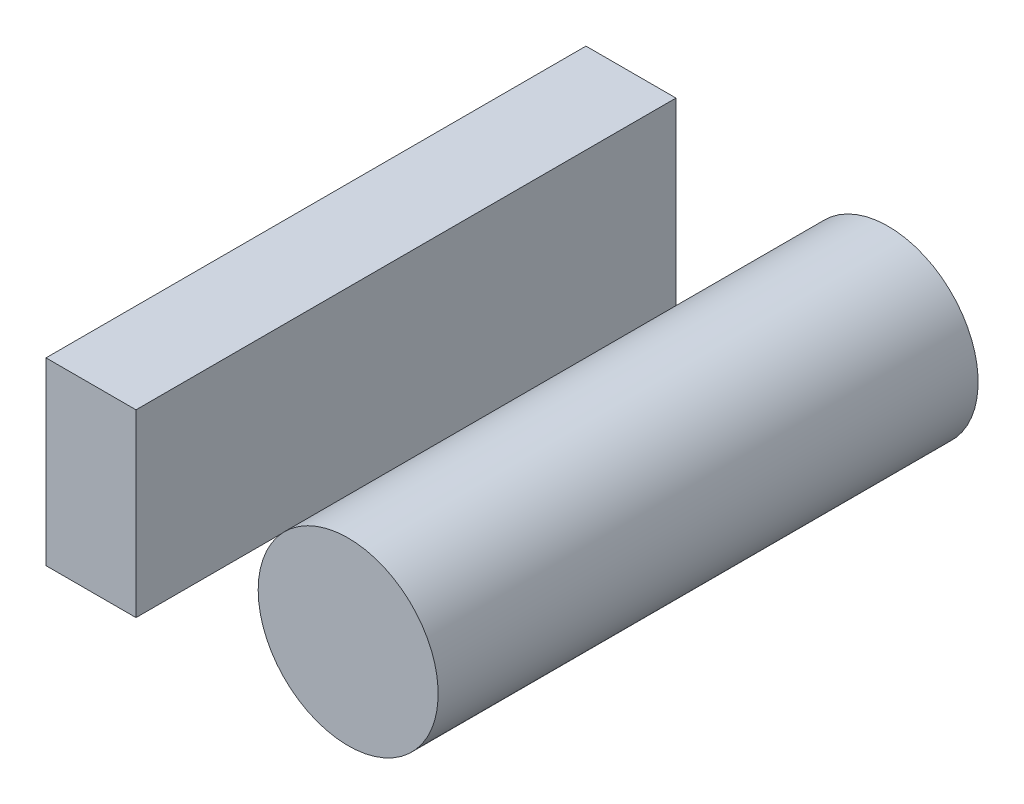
ISO-10303-21;
HEADER;
FILE_DESCRIPTION(('STEP AP214'),'2;1');
FILE_NAME('part.step','',(''),(''),'','','');
FILE_SCHEMA(('AUTOMOTIVE_DESIGN { 1 0 10303 214 1 1 1 1 }'));
ENDSEC;
DATA;
#1=APPLICATION_CONTEXT('core data for automotive mechanical design processes');
#2=APPLICATION_PROTOCOL_DEFINITION('international standard','automotive_design',2000,#1);
#3=PRODUCT_CONTEXT('',#1,'mechanical');
#4=PRODUCT('Part','Part','',(#3));
#5=PRODUCT_RELATED_PRODUCT_CATEGORY('part','',(#4));
#6=PRODUCT_DEFINITION_FORMATION('','',#4);
#7=PRODUCT_DEFINITION_CONTEXT('part definition',#1,'design');
#8=PRODUCT_DEFINITION('design','',#6,#7);
#9=PRODUCT_DEFINITION_SHAPE('','',#8);
#10=(LENGTH_UNIT() NAMED_UNIT(*) SI_UNIT(.MILLI.,.METRE.));
#11=(NAMED_UNIT(*) PLANE_ANGLE_UNIT() SI_UNIT($,.RADIAN.));
#12=(NAMED_UNIT(*) SI_UNIT($,.STERADIAN.) SOLID_ANGLE_UNIT());
#13=UNCERTAINTY_MEASURE_WITH_UNIT(LENGTH_MEASURE(1.E-05),#10,'distance_accuracy_value','');
#14=(GEOMETRIC_REPRESENTATION_CONTEXT(3) GLOBAL_UNCERTAINTY_ASSIGNED_CONTEXT((#13)) GLOBAL_UNIT_ASSIGNED_CONTEXT((#10,
#11,#12)) REPRESENTATION_CONTEXT('',''));
#15=CARTESIAN_POINT('',(0.,0.,0.));
#16=DIRECTION('',(0.,0.,1.));
#17=DIRECTION('',(1.,0.,0.));
#18=AXIS2_PLACEMENT_3D('',#15,#16,#17);
#19=CARTESIAN_POINT('',(-45.1344530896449,16.4486399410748,60.));
#20=DIRECTION('',(0.,0.,-1.));
#21=DIRECTION('',(-1.,0.,0.));
#22=AXIS2_PLACEMENT_3D('',#19,#20,#21);
#23=CYLINDRICAL_SURFACE('',#22,10.);
#24=CARTESIAN_POINT('',(-45.1344530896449,16.4486399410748,60.));
#25=DIRECTION('',(0.,0.,1.));
#26=DIRECTION('',(1.,0.,0.));
#27=AXIS2_PLACEMENT_3D('',#24,#25,#26);
#28=CIRCLE('',#27,10.);
#29=CARTESIAN_POINT('',(-55.1344530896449,16.4486399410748,60.));
#30=VERTEX_POINT('',#29);
#31=EDGE_CURVE('E11',#30,#30,#28,.T.);
#32=CARTESIAN_POINT('',(-45.1344530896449,16.4486399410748,0.));
#33=DIRECTION('',(0.,0.,1.));
#34=DIRECTION('',(1.,0.,0.));
#35=AXIS2_PLACEMENT_3D('',#32,#33,#34);
#36=CIRCLE('',#35,10.);
#37=CARTESIAN_POINT('',(-55.1344530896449,16.4486399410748,0.));
#38=VERTEX_POINT('',#37);
#39=EDGE_CURVE('E362',#38,#38,#36,.T.);
#40=CARTESIAN_POINT('',(-55.1344530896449,16.4486399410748,60.));
#41=CARTESIAN_POINT('',(-55.1344530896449,16.4486399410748,59.375));
#42=CARTESIAN_POINT('',(-55.1344530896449,16.4486399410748,58.75));
#43=CARTESIAN_POINT('',(-55.1344530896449,16.4486399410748,57.5));
#44=CARTESIAN_POINT('',(-55.1344530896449,16.4486399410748,56.875));
#45=CARTESIAN_POINT('',(-55.1344530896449,16.4486399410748,55.625));
#46=CARTESIAN_POINT('',(-55.1344530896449,16.4486399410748,55.));
#47=CARTESIAN_POINT('',(-55.1344530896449,16.4486399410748,53.75));
#48=CARTESIAN_POINT('',(-55.1344530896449,16.4486399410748,53.125));
#49=CARTESIAN_POINT('',(-55.1344530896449,16.4486399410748,51.875));
#50=CARTESIAN_POINT('',(-55.1344530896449,16.4486399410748,51.25));
#51=CARTESIAN_POINT('',(-55.1344530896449,16.4486399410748,50.));
#52=CARTESIAN_POINT('',(-55.1344530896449,16.4486399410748,49.375));
#53=CARTESIAN_POINT('',(-55.1344530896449,16.4486399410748,48.125));
#54=CARTESIAN_POINT('',(-55.1344530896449,16.4486399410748,47.5));
#55=CARTESIAN_POINT('',(-55.1344530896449,16.4486399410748,46.25));
#56=CARTESIAN_POINT('',(-55.1344530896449,16.4486399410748,45.625));
#57=CARTESIAN_POINT('',(-55.1344530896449,16.4486399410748,44.375));
#58=CARTESIAN_POINT('',(-55.1344530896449,16.4486399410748,43.75));
#59=CARTESIAN_POINT('',(-55.1344530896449,16.4486399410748,42.5));
#60=CARTESIAN_POINT('',(-55.1344530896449,16.4486399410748,41.875));
#61=CARTESIAN_POINT('',(-55.1344530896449,16.4486399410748,40.625));
#62=CARTESIAN_POINT('',(-55.1344530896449,16.4486399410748,40.));
#63=CARTESIAN_POINT('',(-55.1344530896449,16.4486399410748,38.75));
#64=CARTESIAN_POINT('',(-55.1344530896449,16.4486399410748,38.125));
#65=CARTESIAN_POINT('',(-55.1344530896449,16.4486399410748,36.875));
#66=CARTESIAN_POINT('',(-55.1344530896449,16.4486399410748,36.25));
#67=CARTESIAN_POINT('',(-55.1344530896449,16.4486399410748,35.));
#68=CARTESIAN_POINT('',(-55.1344530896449,16.4486399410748,34.375));
#69=CARTESIAN_POINT('',(-55.1344530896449,16.4486399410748,33.125));
#70=CARTESIAN_POINT('',(-55.1344530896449,16.4486399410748,32.5));
#71=CARTESIAN_POINT('',(-55.1344530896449,16.4486399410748,31.25));
#72=CARTESIAN_POINT('',(-55.1344530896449,16.4486399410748,30.625));
#73=CARTESIAN_POINT('',(-55.1344530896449,16.4486399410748,29.375));
#74=CARTESIAN_POINT('',(-55.1344530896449,16.4486399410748,28.75));
#75=CARTESIAN_POINT('',(-55.1344530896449,16.4486399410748,27.5));
#76=CARTESIAN_POINT('',(-55.1344530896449,16.4486399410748,26.875));
#77=CARTESIAN_POINT('',(-55.1344530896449,16.4486399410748,25.625));
#78=CARTESIAN_POINT('',(-55.1344530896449,16.4486399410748,25.));
#79=CARTESIAN_POINT('',(-55.1344530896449,16.4486399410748,23.75));
#80=CARTESIAN_POINT('',(-55.1344530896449,16.4486399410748,23.125));
#81=CARTESIAN_POINT('',(-55.1344530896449,16.4486399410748,21.875));
#82=CARTESIAN_POINT('',(-55.1344530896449,16.4486399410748,21.25));
#83=CARTESIAN_POINT('',(-55.1344530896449,16.4486399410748,20.));
#84=CARTESIAN_POINT('',(-55.1344530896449,16.4486399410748,19.375));
#85=CARTESIAN_POINT('',(-55.1344530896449,16.4486399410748,18.125));
#86=CARTESIAN_POINT('',(-55.1344530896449,16.4486399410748,17.5));
#87=CARTESIAN_POINT('',(-55.1344530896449,16.4486399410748,16.25));
#88=CARTESIAN_POINT('',(-55.1344530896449,16.4486399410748,15.625));
#89=CARTESIAN_POINT('',(-55.1344530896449,16.4486399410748,14.375));
#90=CARTESIAN_POINT('',(-55.1344530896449,16.4486399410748,13.75));
#91=CARTESIAN_POINT('',(-55.1344530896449,16.4486399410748,12.5));
#92=CARTESIAN_POINT('',(-55.1344530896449,16.4486399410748,11.875));
#93=CARTESIAN_POINT('',(-55.1344530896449,16.4486399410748,10.625));
#94=CARTESIAN_POINT('',(-55.1344530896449,16.4486399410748,10.));
#95=CARTESIAN_POINT('',(-55.1344530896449,16.4486399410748,8.75));
#96=CARTESIAN_POINT('',(-55.1344530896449,16.4486399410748,8.125));
#97=CARTESIAN_POINT('',(-55.1344530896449,16.4486399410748,6.875));
#98=CARTESIAN_POINT('',(-55.1344530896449,16.4486399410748,6.25));
#99=CARTESIAN_POINT('',(-55.1344530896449,16.4486399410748,5.));
#100=CARTESIAN_POINT('',(-55.1344530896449,16.4486399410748,4.375));
#101=CARTESIAN_POINT('',(-55.1344530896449,16.4486399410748,3.125));
#102=CARTESIAN_POINT('',(-55.1344530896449,16.4486399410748,2.5));
#103=CARTESIAN_POINT('',(-55.1344530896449,16.4486399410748,1.25));
#104=CARTESIAN_POINT('',(-55.1344530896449,16.4486399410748,0.625000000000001));
#105=CARTESIAN_POINT('',(-55.1344530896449,16.4486399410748,0.));
#106=B_SPLINE_CURVE_WITH_KNOTS('',3,(#40,#41,#42,#43,#44,#45,#46,#47,#48,#49,#50,#51,#52,#53,
#54,#55,#56,#57,#58,#59,#60,#61,#62,#63,#64,#65,#66,#67,#68,#69,#70,#71,#72,#73,#74,#75,#76,#77,
#78,#79,#80,#81,#82,#83,#84,#85,#86,#87,#88,#89,#90,#91,#92,#93,#94,#95,#96,#97,#98,#99,#100,
#101,#102,#103,#104,#105),.UNSPECIFIED.,.F.,.F.,(4,2,2,2,2,2,2,2,2,2,2,2,2,2,2,2,2,2,2,2,2,2,2,
2,2,2,2,2,2,2,2,2,4),(0.,1.875,3.75,5.62500000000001,7.50000000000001,9.375,11.25,13.125,15.,
16.875,18.75,20.625,22.5,24.375,26.25,28.125,30.,31.875,33.75,35.625,37.5,39.375,41.25,43.125,
45.,46.875,48.75,50.625,52.5,54.375,56.25,58.125,60.),.UNSPECIFIED.);
#107=EDGE_CURVE('BSEAM356',#30,#38,#106,.T.);
#108=ORIENTED_EDGE('',*,*,#31,.F.);
#109=ORIENTED_EDGE('',*,*,#39,.T.);
#110=ORIENTED_EDGE('',*,*,#107,.T.);
#111=ORIENTED_EDGE('',*,*,#107,.F.);
#112=EDGE_LOOP('',(#108,#110,#109,#111));
#113=FACE_BOUND('',#112,.T.);
#114=ADVANCED_FACE('F356',(#113),#23,.T.);
#115=CARTESIAN_POINT('',(-45.1344530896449,16.4486399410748,60.));
#116=DIRECTION('',(0.,0.,1.));
#117=DIRECTION('',(1.,0.,0.));
#118=AXIS2_PLACEMENT_3D('',#115,#116,#117);
#119=PLANE('',#118);
#120=ORIENTED_EDGE('',*,*,#31,.T.);
#121=EDGE_LOOP('',(#120));
#122=FACE_BOUND('',#121,.T.);
#123=ADVANCED_FACE('F371',(#122),#119,.T.);
#124=CARTESIAN_POINT('',(-45.1344530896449,16.4486399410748,0.));
#125=DIRECTION('',(0.,0.,1.));
#126=DIRECTION('',(1.,0.,0.));
#127=AXIS2_PLACEMENT_3D('',#124,#125,#126);
#128=PLANE('',#127);
#129=ORIENTED_EDGE('',*,*,#39,.F.);
#130=EDGE_LOOP('',(#129));
#131=FACE_BOUND('',#130,.T.);
#132=ADVANCED_FACE('F369',(#131),#128,.F.);
#133=CLOSED_SHELL('',(#114,#123,#132));
#134=MANIFOLD_SOLID_BREP('B2',#133);
#135=CARTESIAN_POINT('',(-78.7100294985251,26.9921828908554,60.));
#136=DIRECTION('',(1.,0.,0.));
#137=DIRECTION('',(0.,0.,-1.));
#138=AXIS2_PLACEMENT_3D('',#135,#136,#137);
#139=PLANE('',#138);
#140=DIRECTION('',(0.,-1.,0.));
#141=VECTOR('',#140,1.);
#142=CARTESIAN_POINT('',(-78.7100294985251,26.9921828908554,0.));
#143=LINE('',#142,#141);
#144=CARTESIAN_POINT('',(-78.7100294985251,26.9921828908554,0.));
#145=VERTEX_POINT('',#144);
#146=CARTESIAN_POINT('',(-78.7100294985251,6.99218289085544,0.));
#147=VERTEX_POINT('',#146);
#148=EDGE_CURVE('E434',#145,#147,#143,.T.);
#149=ORIENTED_EDGE('',*,*,#148,.T.);
#150=DIRECTION('',(0.,0.,-1.));
#151=VECTOR('',#150,1.);
#152=CARTESIAN_POINT('',(-78.7100294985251,6.99218289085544,60.));
#153=LINE('',#152,#151);
#154=CARTESIAN_POINT('',(-78.7100294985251,6.99218289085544,60.));
#155=VERTEX_POINT('',#154);
#156=EDGE_CURVE('E354',#155,#147,#153,.T.);
#157=ORIENTED_EDGE('',*,*,#156,.F.);
#158=DIRECTION('',(0.,-1.,0.));
#159=VECTOR('',#158,1.);
#160=CARTESIAN_POINT('',(-78.7100294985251,26.9921828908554,60.));
#161=LINE('',#160,#159);
#162=CARTESIAN_POINT('',(-78.7100294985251,26.9921828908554,60.));
#163=VERTEX_POINT('',#162);
#164=EDGE_CURVE('E452',#163,#155,#161,.T.);
#165=ORIENTED_EDGE('',*,*,#164,.F.);
#166=DIRECTION('',(0.,0.,-1.));
#167=VECTOR('',#166,1.);
#168=CARTESIAN_POINT('',(-78.7100294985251,26.9921828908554,60.));
#169=LINE('',#168,#167);
#170=EDGE_CURVE('E446',#163,#145,#169,.T.);
#171=ORIENTED_EDGE('',*,*,#170,.T.);
#172=EDGE_LOOP('',(#149,#157,#165,#171));
#173=FACE_BOUND('',#172,.T.);
#174=ADVANCED_FACE('F390',(#173),#139,.F.);
#175=CARTESIAN_POINT('',(-78.7100294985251,6.99218289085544,60.));
#176=DIRECTION('',(0.,1.,0.));
#177=DIRECTION('',(0.,0.,1.));
#178=AXIS2_PLACEMENT_3D('',#175,#176,#177);
#179=PLANE('',#178);
#180=DIRECTION('',(1.,0.,0.));
#181=VECTOR('',#180,1.);
#182=CARTESIAN_POINT('',(-78.7100294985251,6.99218289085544,0.));
#183=LINE('',#182,#181);
#184=CARTESIAN_POINT('',(-68.7100294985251,6.99218289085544,0.));
#185=VERTEX_POINT('',#184);
#186=EDGE_CURVE('E430',#147,#185,#183,.T.);
#187=ORIENTED_EDGE('',*,*,#186,.T.);
#188=DIRECTION('',(0.,0.,-1.));
#189=VECTOR('',#188,1.);
#190=CARTESIAN_POINT('',(-68.7100294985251,6.99218289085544,60.));
#191=LINE('',#190,#189);
#192=CARTESIAN_POINT('',(-68.7100294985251,6.99218289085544,60.));
#193=VERTEX_POINT('',#192);
#194=EDGE_CURVE('E397',#193,#185,#191,.T.);
#195=ORIENTED_EDGE('',*,*,#194,.F.);
#196=DIRECTION('',(1.,0.,0.));
#197=VECTOR('',#196,1.);
#198=CARTESIAN_POINT('',(-78.7100294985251,6.99218289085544,60.));
#199=LINE('',#198,#197);
#200=EDGE_CURVE('E442',#155,#193,#199,.T.);
#201=ORIENTED_EDGE('',*,*,#200,.F.);
#202=ORIENTED_EDGE('',*,*,#156,.T.);
#203=EDGE_LOOP('',(#187,#195,#201,#202));
#204=FACE_BOUND('',#203,.T.);
#205=ADVANCED_FACE('F441',(#204),#179,.F.);
#206=CARTESIAN_POINT('',(-68.7100294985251,26.9921828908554,60.));
#207=DIRECTION('',(-1.,0.,0.));
#208=DIRECTION('',(0.,-1.,0.));
#209=AXIS2_PLACEMENT_3D('',#206,#207,#208);
#210=PLANE('',#209);
#211=DIRECTION('',(0.,1.,0.));
#212=VECTOR('',#211,1.);
#213=CARTESIAN_POINT('',(-68.7100294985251,26.9921828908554,0.));
#214=LINE('',#213,#212);
#215=CARTESIAN_POINT('',(-68.7100294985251,26.9921828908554,0.));
#216=VERTEX_POINT('',#215);
#217=EDGE_CURVE('E435',#185,#216,#214,.T.);
#218=ORIENTED_EDGE('',*,*,#217,.T.);
#219=DIRECTION('',(0.,0.,-1.));
#220=VECTOR('',#219,1.);
#221=CARTESIAN_POINT('',(-68.7100294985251,26.9921828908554,60.));
#222=LINE('',#221,#220);
#223=CARTESIAN_POINT('',(-68.7100294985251,26.9921828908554,60.));
#224=VERTEX_POINT('',#223);
#225=EDGE_CURVE('E458',#224,#216,#222,.T.);
#226=ORIENTED_EDGE('',*,*,#225,.F.);
#227=DIRECTION('',(0.,1.,0.));
#228=VECTOR('',#227,1.);
#229=CARTESIAN_POINT('',(-68.7100294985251,26.9921828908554,60.));
#230=LINE('',#229,#228);
#231=EDGE_CURVE('E409',#193,#224,#230,.T.);
#232=ORIENTED_EDGE('',*,*,#231,.F.);
#233=ORIENTED_EDGE('',*,*,#194,.T.);
#234=EDGE_LOOP('',(#218,#226,#232,#233));
#235=FACE_BOUND('',#234,.T.);
#236=ADVANCED_FACE('F461',(#235),#210,.F.);
#237=CARTESIAN_POINT('',(-78.7100294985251,26.9921828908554,60.));
#238=DIRECTION('',(0.,-1.,0.));
#239=DIRECTION('',(0.,0.,-1.));
#240=AXIS2_PLACEMENT_3D('',#237,#238,#239);
#241=PLANE('',#240);
#242=DIRECTION('',(-1.,0.,0.));
#243=VECTOR('',#242,1.);
#244=CARTESIAN_POINT('',(-78.7100294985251,26.9921828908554,0.));
#245=LINE('',#244,#243);
#246=EDGE_CURVE('E450',#216,#145,#245,.T.);
#247=ORIENTED_EDGE('',*,*,#246,.T.);
#248=ORIENTED_EDGE('',*,*,#170,.F.);
#249=DIRECTION('',(-1.,0.,0.));
#250=VECTOR('',#249,1.);
#251=CARTESIAN_POINT('',(-78.7100294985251,26.9921828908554,60.));
#252=LINE('',#251,#250);
#253=EDGE_CURVE('E404',#224,#163,#252,.T.);
#254=ORIENTED_EDGE('',*,*,#253,.F.);
#255=ORIENTED_EDGE('',*,*,#225,.T.);
#256=EDGE_LOOP('',(#247,#248,#254,#255));
#257=FACE_BOUND('',#256,.T.);
#258=ADVANCED_FACE('F463',(#257),#241,.F.);
#259=CARTESIAN_POINT('',(-78.7100294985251,6.99218289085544,60.));
#260=DIRECTION('',(0.,0.,1.));
#261=DIRECTION('',(1.,0.,0.));
#262=AXIS2_PLACEMENT_3D('',#259,#260,#261);
#263=PLANE('',#262);
#264=ORIENTED_EDGE('',*,*,#164,.T.);
#265=ORIENTED_EDGE('',*,*,#200,.T.);
#266=ORIENTED_EDGE('',*,*,#231,.T.);
#267=ORIENTED_EDGE('',*,*,#253,.T.);
#268=EDGE_LOOP('',(#264,#265,#266,#267));
#269=FACE_BOUND('',#268,.T.);
#270=ADVANCED_FACE('F464',(#269),#263,.T.);
#271=CARTESIAN_POINT('',(-78.7100294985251,6.99218289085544,0.));
#272=DIRECTION('',(0.,0.,1.));
#273=DIRECTION('',(1.,0.,0.));
#274=AXIS2_PLACEMENT_3D('',#271,#272,#273);
#275=PLANE('',#274);
#276=ORIENTED_EDGE('',*,*,#148,.F.);
#277=ORIENTED_EDGE('',*,*,#246,.F.);
#278=ORIENTED_EDGE('',*,*,#217,.F.);
#279=ORIENTED_EDGE('',*,*,#186,.F.);
#280=EDGE_LOOP('',(#276,#277,#278,#279));
#281=FACE_BOUND('',#280,.T.);
#282=ADVANCED_FACE('F431',(#281),#275,.F.);
#283=CLOSED_SHELL('',(#174,#205,#236,#258,#270,#282));
#284=MANIFOLD_SOLID_BREP('B6',#283);
#285=ADVANCED_BREP_SHAPE_REPRESENTATION('',(#18,#134,#284),#14);
#286=SHAPE_DEFINITION_REPRESENTATION(#9,#285);
ENDSEC;
END-ISO-10303-21;
